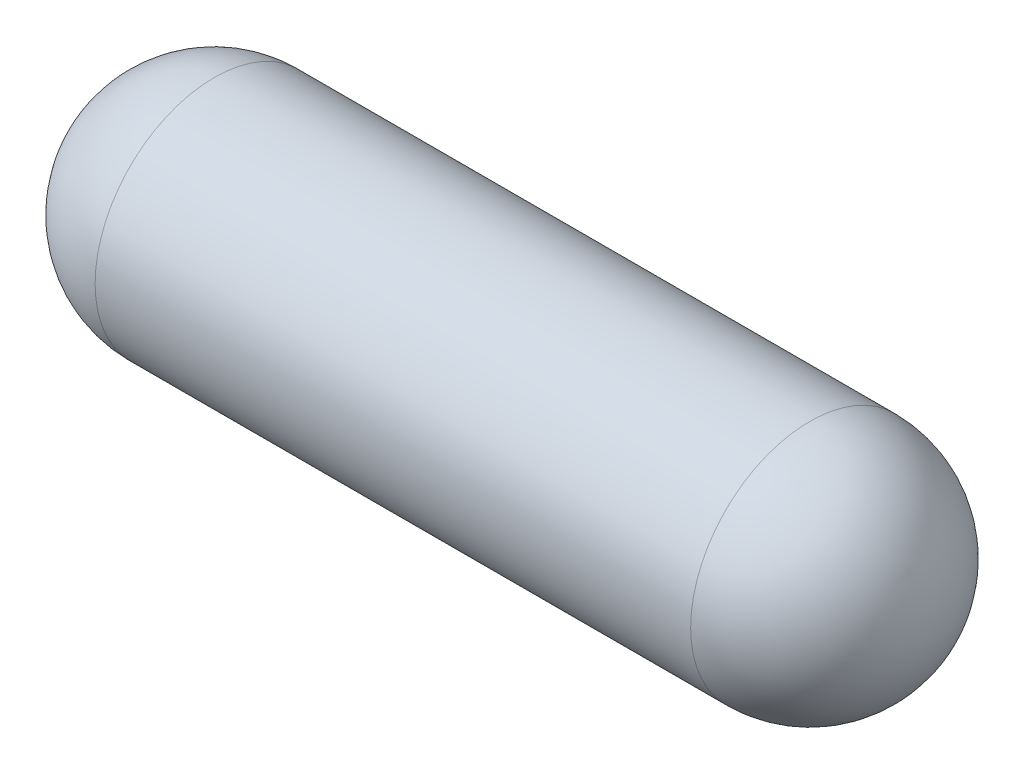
ISO-10303-21;
HEADER;
FILE_DESCRIPTION(('STEP AP214'),'2;1');
FILE_NAME('part.step','',(''),(''),'','','');
FILE_SCHEMA(('AUTOMOTIVE_DESIGN { 1 0 10303 214 1 1 1 1 }'));
ENDSEC;
DATA;
#1=APPLICATION_CONTEXT('core data for automotive mechanical design processes');
#2=APPLICATION_PROTOCOL_DEFINITION('international standard','automotive_design',2000,#1);
#3=PRODUCT_CONTEXT('',#1,'mechanical');
#4=PRODUCT('Part','Part','',(#3));
#5=PRODUCT_RELATED_PRODUCT_CATEGORY('part','',(#4));
#6=PRODUCT_DEFINITION_FORMATION('','',#4);
#7=PRODUCT_DEFINITION_CONTEXT('part definition',#1,'design');
#8=PRODUCT_DEFINITION('design','',#6,#7);
#9=PRODUCT_DEFINITION_SHAPE('','',#8);
#10=(LENGTH_UNIT() NAMED_UNIT(*) SI_UNIT(.MILLI.,.METRE.));
#11=(NAMED_UNIT(*) PLANE_ANGLE_UNIT() SI_UNIT($,.RADIAN.));
#12=(NAMED_UNIT(*) SI_UNIT($,.STERADIAN.) SOLID_ANGLE_UNIT());
#13=UNCERTAINTY_MEASURE_WITH_UNIT(LENGTH_MEASURE(1.E-05),#10,'distance_accuracy_value','');
#14=(GEOMETRIC_REPRESENTATION_CONTEXT(3) GLOBAL_UNCERTAINTY_ASSIGNED_CONTEXT((#13)) GLOBAL_UNIT_ASSIGNED_CONTEXT((#10,
#11,#12)) REPRESENTATION_CONTEXT('',''));
#15=CARTESIAN_POINT('',(0.,0.,0.));
#16=DIRECTION('',(0.,0.,1.));
#17=DIRECTION('',(1.,0.,0.));
#18=AXIS2_PLACEMENT_3D('',#15,#16,#17);
#19=CARTESIAN_POINT('',(80.5,70.,0.));
#20=DIRECTION('',(-1.,0.,0.));
#21=DIRECTION('',(0.,0.,-1.));
#22=AXIS2_PLACEMENT_3D('',#19,#20,#21);
#23=CYLINDRICAL_SURFACE('',#22,1.5);
#24=CARTESIAN_POINT('',(73.,70.,0.));
#25=DIRECTION('',(1.,0.,0.));
#26=DIRECTION('',(0.,1.,0.));
#27=AXIS2_PLACEMENT_3D('',#24,#25,#26);
#28=CIRCLE('',#27,1.5);
#29=CARTESIAN_POINT('',(73.,70.,-1.5));
#30=VERTEX_POINT('',#29);
#31=CARTESIAN_POINT('',(73.,70.,1.5));
#32=VERTEX_POINT('',#31);
#33=EDGE_CURVE('E11',#30,#32,#28,.T.);
#34=ORIENTED_EDGE('',*,*,#33,.T.);
#35=CARTESIAN_POINT('',(73.,70.,0.));
#36=DIRECTION('',(-1.,0.,0.));
#37=DIRECTION('',(0.,-1.,0.));
#38=AXIS2_PLACEMENT_3D('',#35,#36,#37);
#39=CIRCLE('',#38,1.5);
#40=EDGE_CURVE('E24',#30,#32,#39,.T.);
#41=ORIENTED_EDGE('',*,*,#40,.F.);
#42=EDGE_LOOP('',(#34,#41));
#43=FACE_BOUND('',#42,.T.);
#44=CARTESIAN_POINT('',(80.5,70.,0.));
#45=DIRECTION('',(1.,0.,0.));
#46=DIRECTION('',(0.,1.,0.));
#47=AXIS2_PLACEMENT_3D('',#44,#45,#46);
#48=CIRCLE('',#47,1.5);
#49=CARTESIAN_POINT('',(80.5,70.,-1.5));
#50=VERTEX_POINT('',#49);
#51=CARTESIAN_POINT('',(80.5,70.,1.5));
#52=VERTEX_POINT('',#51);
#53=EDGE_CURVE('E40',#50,#52,#48,.T.);
#54=ORIENTED_EDGE('',*,*,#53,.F.);
#55=CARTESIAN_POINT('',(80.5,70.,0.));
#56=DIRECTION('',(-1.,0.,0.));
#57=DIRECTION('',(0.,-1.,0.));
#58=AXIS2_PLACEMENT_3D('',#55,#56,#57);
#59=CIRCLE('',#58,1.5);
#60=EDGE_CURVE('E30',#50,#52,#59,.T.);
#61=ORIENTED_EDGE('',*,*,#60,.T.);
#62=EDGE_LOOP('',(#54,#61));
#63=FACE_BOUND('',#62,.T.);
#64=ADVANCED_FACE('F16',(#43,#63),#23,.T.);
#65=CARTESIAN_POINT('',(73.,70.,0.));
#66=DIRECTION('',(0.,0.,1.));
#67=DIRECTION('',(0.,1.,0.));
#68=AXIS2_PLACEMENT_3D('',#65,#66,#67);
#69=SPHERICAL_SURFACE('',#68,1.5);
#70=CARTESIAN_POINT('',(73.,70.,0.));
#71=DIRECTION('',(1.,0.,0.));
#72=DIRECTION('',(0.,1.,0.));
#73=AXIS2_PLACEMENT_3D('',#70,#71,#72);
#74=SPHERICAL_SURFACE('',#73,1.5);
#75=ORIENTED_EDGE('',*,*,#33,.F.);
#76=ORIENTED_EDGE('',*,*,#40,.T.);
#77=EDGE_LOOP('',(#75,#76));
#78=FACE_BOUND('',#77,.T.);
#79=ADVANCED_FACE('F62',(#78),#74,.T.);
#80=CARTESIAN_POINT('',(80.5,70.,0.));
#81=DIRECTION('',(0.,0.,1.));
#82=DIRECTION('',(0.,-1.,0.));
#83=AXIS2_PLACEMENT_3D('',#80,#81,#82);
#84=SPHERICAL_SURFACE('',#83,1.5);
#85=CARTESIAN_POINT('',(80.5,70.,0.));
#86=DIRECTION('',(-1.,0.,0.));
#87=DIRECTION('',(0.,-1.,0.));
#88=AXIS2_PLACEMENT_3D('',#85,#86,#87);
#89=SPHERICAL_SURFACE('',#88,1.5);
#90=ORIENTED_EDGE('',*,*,#60,.F.);
#91=ORIENTED_EDGE('',*,*,#53,.T.);
#92=EDGE_LOOP('',(#90,#91));
#93=FACE_BOUND('',#92,.T.);
#94=ADVANCED_FACE('F41',(#93),#89,.T.);
#95=CLOSED_SHELL('',(#64,#79,#94));
#96=MANIFOLD_SOLID_BREP('B1',#95);
#97=ADVANCED_BREP_SHAPE_REPRESENTATION('',(#18,#96),#14);
#98=SHAPE_DEFINITION_REPRESENTATION(#9,#97);
ENDSEC;
END-ISO-10303-21;
